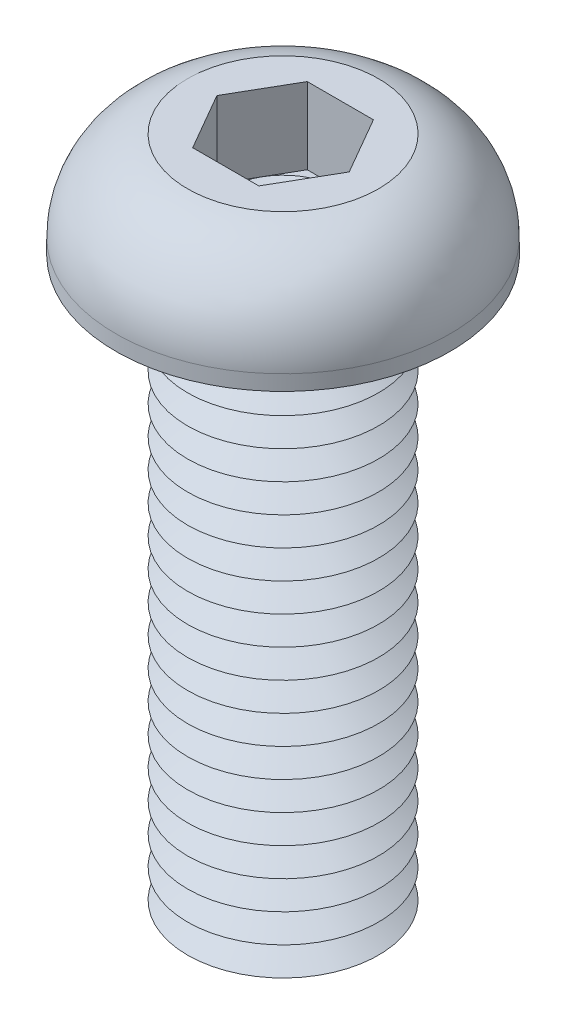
ISO-10303-21;
HEADER;
FILE_DESCRIPTION(('STEP AP214'),'2;1');
FILE_NAME('part.step','',(''),(''),'','','');
FILE_SCHEMA(('AUTOMOTIVE_DESIGN { 1 0 10303 214 1 1 1 1 }'));
ENDSEC;
DATA;
#1=APPLICATION_CONTEXT('core data for automotive mechanical design processes');
#2=APPLICATION_PROTOCOL_DEFINITION('international standard','automotive_design',2000,#1);
#3=PRODUCT_CONTEXT('',#1,'mechanical');
#4=PRODUCT('Part','Part','',(#3));
#5=PRODUCT_RELATED_PRODUCT_CATEGORY('part','',(#4));
#6=PRODUCT_DEFINITION_FORMATION('','',#4);
#7=PRODUCT_DEFINITION_CONTEXT('part definition',#1,'design');
#8=PRODUCT_DEFINITION('design','',#6,#7);
#9=PRODUCT_DEFINITION_SHAPE('','',#8);
#10=(LENGTH_UNIT() NAMED_UNIT(*) SI_UNIT(.MILLI.,.METRE.));
#11=(NAMED_UNIT(*) PLANE_ANGLE_UNIT() SI_UNIT($,.RADIAN.));
#12=(NAMED_UNIT(*) SI_UNIT($,.STERADIAN.) SOLID_ANGLE_UNIT());
#13=UNCERTAINTY_MEASURE_WITH_UNIT(LENGTH_MEASURE(1.E-05),#10,'distance_accuracy_value','');
#14=(GEOMETRIC_REPRESENTATION_CONTEXT(3) GLOBAL_UNCERTAINTY_ASSIGNED_CONTEXT((#13)) GLOBAL_UNIT_ASSIGNED_CONTEXT((#10,
#11,#12)) REPRESENTATION_CONTEXT('',''));
#15=CARTESIAN_POINT('',(0.,0.,0.));
#16=DIRECTION('',(0.,0.,1.));
#17=DIRECTION('',(1.,0.,0.));
#18=AXIS2_PLACEMENT_3D('',#15,#16,#17);
#19=CARTESIAN_POINT('',(0.,0.,0.));
#20=DIRECTION('',(0.,-1.,0.));
#21=DIRECTION('',(0.,0.,-1.));
#22=AXIS2_PLACEMENT_3D('',#19,#20,#21);
#23=TOROIDAL_SURFACE('',#22,5.75,0.75);
#24=CARTESIAN_POINT('',(0.,0.,-6.5));
#25=VERTEX_POINT('',#24);
#26=VERTEX_LOOP('',#25);
#27=FACE_BOUND('',#26,.T.);
#28=ADVANCED_FACE('P0_F12',(#27),#23,.T.);
#29=CLOSED_SHELL('',(#28));
#30=MANIFOLD_SOLID_BREP('P0_B1',#29);
#31=CARTESIAN_POINT('',(1.73205080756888,1.5,-3.));
#32=DIRECTION('',(0.,1.,0.));
#33=DIRECTION('',(0.,0.,1.));
#34=AXIS2_PLACEMENT_3D('',#31,#32,#33);
#35=PLANE('',#34);
#36=CARTESIAN_POINT('',(0.,1.5,0.));
#37=DIRECTION('',(0.,1.,0.));
#38=DIRECTION('',(0.,0.,1.));
#39=AXIS2_PLACEMENT_3D('',#36,#37,#38);
#40=CIRCLE('',#39,3.);
#41=CARTESIAN_POINT('',(0.,1.5,3.));
#42=VERTEX_POINT('',#41);
#43=CARTESIAN_POINT('',(2.59807621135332,1.5,1.5));
#44=VERTEX_POINT('',#43);
#45=EDGE_CURVE('P1_E93',#42,#44,#40,.T.);
#46=ORIENTED_EDGE('',*,*,#45,.F.);
#47=DIRECTION('',(1.,0.,0.));
#48=VECTOR('',#47,1.);
#49=CARTESIAN_POINT('',(-1.73205080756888,1.5,3.));
#50=LINE('',#49,#48);
#51=CARTESIAN_POINT('',(1.73205080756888,1.5,3.));
#52=VERTEX_POINT('',#51);
#53=EDGE_CURVE('P1_E116',#42,#52,#50,.T.);
#54=ORIENTED_EDGE('',*,*,#53,.T.);
#55=DIRECTION('',(0.5,0.,-0.866025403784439));
#56=VECTOR('',#55,1.);
#57=CARTESIAN_POINT('',(1.73205080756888,1.5,3.));
#58=LINE('',#57,#56);
#59=EDGE_CURVE('P1_E112',#52,#44,#58,.T.);
#60=ORIENTED_EDGE('',*,*,#59,.T.);
#61=EDGE_LOOP('',(#46,#54,#60));
#62=FACE_BOUND('',#61,.T.);
#63=ADVANCED_FACE('P1_F15',(#62),#35,.T.);
#64=CARTESIAN_POINT('',(0.,1.5,0.));
#65=DIRECTION('',(0.,1.,0.));
#66=DIRECTION('',(0.,0.,1.));
#67=AXIS2_PLACEMENT_3D('',#64,#65,#66);
#68=CIRCLE('',#67,3.);
#69=CARTESIAN_POINT('',(2.59807621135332,1.5,-1.5));
#70=VERTEX_POINT('',#69);
#71=EDGE_CURVE('P1_E10',#44,#70,#68,.T.);
#72=ORIENTED_EDGE('',*,*,#71,.F.);
#73=CARTESIAN_POINT('',(3.46410161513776,1.5,0.));
#74=VERTEX_POINT('',#73);
#75=EDGE_CURVE('P1_E104',#44,#74,#58,.T.);
#76=ORIENTED_EDGE('',*,*,#75,.T.);
#77=DIRECTION('',(-0.5,0.,-0.866025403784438));
#78=VECTOR('',#77,1.);
#79=CARTESIAN_POINT('',(3.46410161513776,1.5,0.));
#80=LINE('',#79,#78);
#81=EDGE_CURVE('P1_E107',#74,#70,#80,.T.);
#82=ORIENTED_EDGE('',*,*,#81,.T.);
#83=EDGE_LOOP('',(#72,#76,#82));
#84=FACE_BOUND('',#83,.T.);
#85=ADVANCED_FACE('P1_F103',(#84),#35,.T.);
#86=CARTESIAN_POINT('',(0.,1.5,-3.));
#87=VERTEX_POINT('',#86);
#88=EDGE_CURVE('P1_E24',#70,#87,#68,.T.);
#89=ORIENTED_EDGE('',*,*,#88,.F.);
#90=CARTESIAN_POINT('',(1.73205080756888,1.5,-3.));
#91=VERTEX_POINT('',#90);
#92=EDGE_CURVE('P1_E139',#70,#91,#80,.T.);
#93=ORIENTED_EDGE('',*,*,#92,.T.);
#94=DIRECTION('',(-1.,0.,0.));
#95=VECTOR('',#94,1.);
#96=CARTESIAN_POINT('',(1.73205080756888,1.5,-3.));
#97=LINE('',#96,#95);
#98=EDGE_CURVE('P1_E336',#91,#87,#97,.T.);
#99=ORIENTED_EDGE('',*,*,#98,.T.);
#100=EDGE_LOOP('',(#89,#93,#99));
#101=FACE_BOUND('',#100,.T.);
#102=ADVANCED_FACE('P1_F301',(#101),#35,.T.);
#103=CARTESIAN_POINT('',(-2.59807621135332,1.5,-1.5));
#104=VERTEX_POINT('',#103);
#105=EDGE_CURVE('P1_E331',#87,#104,#68,.T.);
#106=ORIENTED_EDGE('',*,*,#105,.F.);
#107=CARTESIAN_POINT('',(-1.73205080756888,1.5,-3.));
#108=VERTEX_POINT('',#107);
#109=EDGE_CURVE('P1_E340',#87,#108,#97,.T.);
#110=ORIENTED_EDGE('',*,*,#109,.T.);
#111=DIRECTION('',(-0.5,0.,0.866025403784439));
#112=VECTOR('',#111,1.);
#113=CARTESIAN_POINT('',(-1.73205080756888,1.5,-3.));
#114=LINE('',#113,#112);
#115=EDGE_CURVE('P1_E335',#108,#104,#114,.T.);
#116=ORIENTED_EDGE('',*,*,#115,.T.);
#117=EDGE_LOOP('',(#106,#110,#116));
#118=FACE_BOUND('',#117,.T.);
#119=ADVANCED_FACE('P1_F315',(#118),#35,.T.);
#120=CARTESIAN_POINT('',(-2.59807621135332,1.5,1.5));
#121=VERTEX_POINT('',#120);
#122=EDGE_CURVE('P1_E31',#104,#121,#68,.T.);
#123=ORIENTED_EDGE('',*,*,#122,.F.);
#124=CARTESIAN_POINT('',(-3.46410161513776,1.5,0.));
#125=VERTEX_POINT('',#124);
#126=EDGE_CURVE('P1_E327',#104,#125,#114,.T.);
#127=ORIENTED_EDGE('',*,*,#126,.T.);
#128=DIRECTION('',(0.5,0.,0.866025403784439));
#129=VECTOR('',#128,1.);
#130=CARTESIAN_POINT('',(-3.46410161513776,1.5,0.));
#131=LINE('',#130,#129);
#132=EDGE_CURVE('P1_E330',#125,#121,#131,.T.);
#133=ORIENTED_EDGE('',*,*,#132,.T.);
#134=EDGE_LOOP('',(#123,#127,#133));
#135=FACE_BOUND('',#134,.T.);
#136=ADVANCED_FACE('P1_F306',(#135),#35,.T.);
#137=CARTESIAN_POINT('',(0.,-28.5,0.));
#138=DIRECTION('',(0.,1.,0.));
#139=DIRECTION('',(0.,0.,1.));
#140=AXIS2_PLACEMENT_3D('',#137,#138,#139);
#141=CONICAL_SURFACE('',#140,3.70096189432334,1.0471975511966);
#142=CARTESIAN_POINT('',(0.,-27.75,0.));
#143=DIRECTION('',(0.,-1.,0.));
#144=DIRECTION('',(0.,0.,-1.));
#145=AXIS2_PLACEMENT_3D('',#142,#143,#144);
#146=CIRCLE('',#145,5.);
#147=CARTESIAN_POINT('',(0.,-27.75,-5.));
#148=VERTEX_POINT('',#147);
#149=EDGE_CURVE('P1_E263',#148,#148,#146,.T.);
#150=ORIENTED_EDGE('',*,*,#149,.T.);
#151=EDGE_LOOP('',(#150));
#152=FACE_BOUND('',#151,.T.);
#153=CARTESIAN_POINT('',(0.,-28.5,0.));
#154=DIRECTION('',(0.,-1.,0.));
#155=DIRECTION('',(0.,0.,-1.));
#156=AXIS2_PLACEMENT_3D('',#153,#154,#155);
#157=CIRCLE('',#156,3.70096189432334);
#158=CARTESIAN_POINT('',(0.,-28.5,-3.70096189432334));
#159=VERTEX_POINT('',#158);
#160=EDGE_CURVE('P1_E266',#159,#159,#157,.T.);
#161=ORIENTED_EDGE('',*,*,#160,.F.);
#162=EDGE_LOOP('',(#161));
#163=FACE_BOUND('',#162,.T.);
#164=ADVANCED_FACE('P1_F314',(#152,#163),#141,.T.);
#165=CARTESIAN_POINT('',(0.,-29.25,0.));
#166=DIRECTION('',(0.,-1.,0.));
#167=DIRECTION('',(0.,0.,-1.));
#168=AXIS2_PLACEMENT_3D('',#165,#166,#167);
#169=CONICAL_SURFACE('',#168,5.,1.0471975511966);
#170=ORIENTED_EDGE('',*,*,#160,.T.);
#171=EDGE_LOOP('',(#170));
#172=FACE_BOUND('',#171,.T.);
#173=CARTESIAN_POINT('',(0.,-29.25,0.));
#174=DIRECTION('',(0.,-1.,0.));
#175=DIRECTION('',(0.,0.,-1.));
#176=AXIS2_PLACEMENT_3D('',#173,#174,#175);
#177=CIRCLE('',#176,5.);
#178=CARTESIAN_POINT('',(0.,-29.25,-5.));
#179=VERTEX_POINT('',#178);
#180=EDGE_CURVE('P1_E269',#179,#179,#177,.T.);
#181=ORIENTED_EDGE('',*,*,#180,.F.);
#182=EDGE_LOOP('',(#181));
#183=FACE_BOUND('',#182,.T.);
#184=ADVANCED_FACE('P1_F321',(#172,#183),#169,.T.);
#185=CARTESIAN_POINT('',(0.,-30.,0.));
#186=DIRECTION('',(0.,1.,0.));
#187=DIRECTION('',(0.,0.,1.));
#188=AXIS2_PLACEMENT_3D('',#185,#186,#187);
#189=PLANE('',#188);
#190=CARTESIAN_POINT('',(0.,-30.,0.));
#191=DIRECTION('',(0.,-1.,0.));
#192=DIRECTION('',(0.,0.,-1.));
#193=AXIS2_PLACEMENT_3D('',#190,#191,#192);
#194=CIRCLE('',#193,3.70096189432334);
#195=CARTESIAN_POINT('',(0.,-30.,-3.70096189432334));
#196=VERTEX_POINT('',#195);
#197=EDGE_CURVE('P1_E272',#196,#196,#194,.T.);
#198=ORIENTED_EDGE('',*,*,#197,.T.);
#199=EDGE_LOOP('',(#198));
#200=FACE_BOUND('',#199,.T.);
#201=ADVANCED_FACE('P1_F399',(#200),#189,.F.);
#202=CARTESIAN_POINT('',(0.,-30.,0.));
#203=DIRECTION('',(0.,1.,0.));
#204=DIRECTION('',(0.,0.,1.));
#205=AXIS2_PLACEMENT_3D('',#202,#203,#204);
#206=CONICAL_SURFACE('',#205,3.70096189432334,1.0471975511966);
#207=ORIENTED_EDGE('',*,*,#180,.T.);
#208=EDGE_LOOP('',(#207));
#209=FACE_BOUND('',#208,.T.);
#210=ORIENTED_EDGE('',*,*,#197,.F.);
#211=EDGE_LOOP('',(#210));
#212=FACE_BOUND('',#211,.T.);
#213=ADVANCED_FACE('P1_F410',(#209,#212),#206,.T.);
#214=CARTESIAN_POINT('',(0.,-27.,0.));
#215=DIRECTION('',(0.,1.,0.));
#216=DIRECTION('',(0.,0.,1.));
#217=AXIS2_PLACEMENT_3D('',#214,#215,#216);
#218=CONICAL_SURFACE('',#217,3.70096189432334,1.0471975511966);
#219=CARTESIAN_POINT('',(0.,-26.25,0.));
#220=DIRECTION('',(0.,-1.,0.));
#221=DIRECTION('',(0.,0.,-1.));
#222=AXIS2_PLACEMENT_3D('',#219,#220,#221);
#223=CIRCLE('',#222,5.);
#224=CARTESIAN_POINT('',(0.,-26.25,-5.));
#225=VERTEX_POINT('',#224);
#226=EDGE_CURVE('P1_E257',#225,#225,#223,.T.);
#227=ORIENTED_EDGE('',*,*,#226,.T.);
#228=EDGE_LOOP('',(#227));
#229=FACE_BOUND('',#228,.T.);
#230=CARTESIAN_POINT('',(0.,-27.,0.));
#231=DIRECTION('',(0.,-1.,0.));
#232=DIRECTION('',(0.,0.,-1.));
#233=AXIS2_PLACEMENT_3D('',#230,#231,#232);
#234=CIRCLE('',#233,3.70096189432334);
#235=CARTESIAN_POINT('',(0.,-27.,-3.70096189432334));
#236=VERTEX_POINT('',#235);
#237=EDGE_CURVE('P1_E260',#236,#236,#234,.T.);
#238=ORIENTED_EDGE('',*,*,#237,.F.);
#239=EDGE_LOOP('',(#238));
#240=FACE_BOUND('',#239,.T.);
#241=ADVANCED_FACE('P1_F419',(#229,#240),#218,.T.);
#242=CARTESIAN_POINT('',(0.,-27.75,0.));
#243=DIRECTION('',(0.,-1.,0.));
#244=DIRECTION('',(0.,0.,-1.));
#245=AXIS2_PLACEMENT_3D('',#242,#243,#244);
#246=CONICAL_SURFACE('',#245,5.,1.0471975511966);
#247=ORIENTED_EDGE('',*,*,#237,.T.);
#248=EDGE_LOOP('',(#247));
#249=FACE_BOUND('',#248,.T.);
#250=ORIENTED_EDGE('',*,*,#149,.F.);
#251=EDGE_LOOP('',(#250));
#252=FACE_BOUND('',#251,.T.);
#253=ADVANCED_FACE('P1_F428',(#249,#252),#246,.T.);
#254=CARTESIAN_POINT('',(0.,-25.5,0.));
#255=DIRECTION('',(0.,1.,0.));
#256=DIRECTION('',(0.,0.,1.));
#257=AXIS2_PLACEMENT_3D('',#254,#255,#256);
#258=CONICAL_SURFACE('',#257,3.70096189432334,1.0471975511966);
#259=CARTESIAN_POINT('',(0.,-24.75,0.));
#260=DIRECTION('',(0.,-1.,0.));
#261=DIRECTION('',(0.,0.,-1.));
#262=AXIS2_PLACEMENT_3D('',#259,#260,#261);
#263=CIRCLE('',#262,5.);
#264=CARTESIAN_POINT('',(0.,-24.75,-5.));
#265=VERTEX_POINT('',#264);
#266=EDGE_CURVE('P1_E251',#265,#265,#263,.T.);
#267=ORIENTED_EDGE('',*,*,#266,.T.);
#268=EDGE_LOOP('',(#267));
#269=FACE_BOUND('',#268,.T.);
#270=CARTESIAN_POINT('',(0.,-25.5,0.));
#271=DIRECTION('',(0.,-1.,0.));
#272=DIRECTION('',(0.,0.,-1.));
#273=AXIS2_PLACEMENT_3D('',#270,#271,#272);
#274=CIRCLE('',#273,3.70096189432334);
#275=CARTESIAN_POINT('',(0.,-25.5,-3.70096189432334));
#276=VERTEX_POINT('',#275);
#277=EDGE_CURVE('P1_E254',#276,#276,#274,.T.);
#278=ORIENTED_EDGE('',*,*,#277,.F.);
#279=EDGE_LOOP('',(#278));
#280=FACE_BOUND('',#279,.T.);
#281=ADVANCED_FACE('P1_F438',(#269,#280),#258,.T.);
#282=CARTESIAN_POINT('',(0.,-26.25,0.));
#283=DIRECTION('',(0.,-1.,0.));
#284=DIRECTION('',(0.,0.,-1.));
#285=AXIS2_PLACEMENT_3D('',#282,#283,#284);
#286=CONICAL_SURFACE('',#285,5.,1.0471975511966);
#287=ORIENTED_EDGE('',*,*,#277,.T.);
#288=EDGE_LOOP('',(#287));
#289=FACE_BOUND('',#288,.T.);
#290=ORIENTED_EDGE('',*,*,#226,.F.);
#291=EDGE_LOOP('',(#290));
#292=FACE_BOUND('',#291,.T.);
#293=ADVANCED_FACE('P1_F448',(#289,#292),#286,.T.);
#294=CARTESIAN_POINT('',(0.,-24.,0.));
#295=DIRECTION('',(0.,1.,0.));
#296=DIRECTION('',(0.,0.,1.));
#297=AXIS2_PLACEMENT_3D('',#294,#295,#296);
#298=CONICAL_SURFACE('',#297,3.70096189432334,1.0471975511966);
#299=CARTESIAN_POINT('',(0.,-23.25,0.));
#300=DIRECTION('',(0.,-1.,0.));
#301=DIRECTION('',(0.,0.,-1.));
#302=AXIS2_PLACEMENT_3D('',#299,#300,#301);
#303=CIRCLE('',#302,5.);
#304=CARTESIAN_POINT('',(0.,-23.25,-5.));
#305=VERTEX_POINT('',#304);
#306=EDGE_CURVE('P1_E245',#305,#305,#303,.T.);
#307=ORIENTED_EDGE('',*,*,#306,.T.);
#308=EDGE_LOOP('',(#307));
#309=FACE_BOUND('',#308,.T.);
#310=CARTESIAN_POINT('',(0.,-24.,0.));
#311=DIRECTION('',(0.,-1.,0.));
#312=DIRECTION('',(0.,0.,-1.));
#313=AXIS2_PLACEMENT_3D('',#310,#311,#312);
#314=CIRCLE('',#313,3.70096189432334);
#315=CARTESIAN_POINT('',(0.,-24.,-3.70096189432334));
#316=VERTEX_POINT('',#315);
#317=EDGE_CURVE('P1_E248',#316,#316,#314,.T.);
#318=ORIENTED_EDGE('',*,*,#317,.F.);
#319=EDGE_LOOP('',(#318));
#320=FACE_BOUND('',#319,.T.);
#321=ADVANCED_FACE('P1_F458',(#309,#320),#298,.T.);
#322=CARTESIAN_POINT('',(0.,-24.75,0.));
#323=DIRECTION('',(0.,-1.,0.));
#324=DIRECTION('',(0.,0.,-1.));
#325=AXIS2_PLACEMENT_3D('',#322,#323,#324);
#326=CONICAL_SURFACE('',#325,5.,1.0471975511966);
#327=ORIENTED_EDGE('',*,*,#317,.T.);
#328=EDGE_LOOP('',(#327));
#329=FACE_BOUND('',#328,.T.);
#330=ORIENTED_EDGE('',*,*,#266,.F.);
#331=EDGE_LOOP('',(#330));
#332=FACE_BOUND('',#331,.T.);
#333=ADVANCED_FACE('P1_F468',(#329,#332),#326,.T.);
#334=CARTESIAN_POINT('',(0.,-22.5,0.));
#335=DIRECTION('',(0.,1.,0.));
#336=DIRECTION('',(0.,0.,1.));
#337=AXIS2_PLACEMENT_3D('',#334,#335,#336);
#338=CONICAL_SURFACE('',#337,3.70096189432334,1.0471975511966);
#339=CARTESIAN_POINT('',(0.,-21.75,0.));
#340=DIRECTION('',(0.,-1.,0.));
#341=DIRECTION('',(0.,0.,-1.));
#342=AXIS2_PLACEMENT_3D('',#339,#340,#341);
#343=CIRCLE('',#342,5.);
#344=CARTESIAN_POINT('',(0.,-21.75,-5.));
#345=VERTEX_POINT('',#344);
#346=EDGE_CURVE('P1_E239',#345,#345,#343,.T.);
#347=ORIENTED_EDGE('',*,*,#346,.T.);
#348=EDGE_LOOP('',(#347));
#349=FACE_BOUND('',#348,.T.);
#350=CARTESIAN_POINT('',(0.,-22.5,0.));
#351=DIRECTION('',(0.,-1.,0.));
#352=DIRECTION('',(0.,0.,-1.));
#353=AXIS2_PLACEMENT_3D('',#350,#351,#352);
#354=CIRCLE('',#353,3.70096189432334);
#355=CARTESIAN_POINT('',(0.,-22.5,-3.70096189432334));
#356=VERTEX_POINT('',#355);
#357=EDGE_CURVE('P1_E242',#356,#356,#354,.T.);
#358=ORIENTED_EDGE('',*,*,#357,.F.);
#359=EDGE_LOOP('',(#358));
#360=FACE_BOUND('',#359,.T.);
#361=ADVANCED_FACE('P1_F478',(#349,#360),#338,.T.);
#362=CARTESIAN_POINT('',(0.,-23.25,0.));
#363=DIRECTION('',(0.,-1.,0.));
#364=DIRECTION('',(0.,0.,-1.));
#365=AXIS2_PLACEMENT_3D('',#362,#363,#364);
#366=CONICAL_SURFACE('',#365,5.,1.0471975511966);
#367=ORIENTED_EDGE('',*,*,#357,.T.);
#368=EDGE_LOOP('',(#367));
#369=FACE_BOUND('',#368,.T.);
#370=ORIENTED_EDGE('',*,*,#306,.F.);
#371=EDGE_LOOP('',(#370));
#372=FACE_BOUND('',#371,.T.);
#373=ADVANCED_FACE('P1_F488',(#369,#372),#366,.T.);
#374=CARTESIAN_POINT('',(0.,-21.,0.));
#375=DIRECTION('',(0.,1.,0.));
#376=DIRECTION('',(0.,0.,1.));
#377=AXIS2_PLACEMENT_3D('',#374,#375,#376);
#378=CONICAL_SURFACE('',#377,3.70096189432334,1.0471975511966);
#379=CARTESIAN_POINT('',(0.,-20.25,0.));
#380=DIRECTION('',(0.,-1.,0.));
#381=DIRECTION('',(0.,0.,-1.));
#382=AXIS2_PLACEMENT_3D('',#379,#380,#381);
#383=CIRCLE('',#382,5.);
#384=CARTESIAN_POINT('',(0.,-20.25,-5.));
#385=VERTEX_POINT('',#384);
#386=EDGE_CURVE('P1_E233',#385,#385,#383,.T.);
#387=ORIENTED_EDGE('',*,*,#386,.T.);
#388=EDGE_LOOP('',(#387));
#389=FACE_BOUND('',#388,.T.);
#390=CARTESIAN_POINT('',(0.,-21.,0.));
#391=DIRECTION('',(0.,-1.,0.));
#392=DIRECTION('',(0.,0.,-1.));
#393=AXIS2_PLACEMENT_3D('',#390,#391,#392);
#394=CIRCLE('',#393,3.70096189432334);
#395=CARTESIAN_POINT('',(0.,-21.,-3.70096189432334));
#396=VERTEX_POINT('',#395);
#397=EDGE_CURVE('P1_E236',#396,#396,#394,.T.);
#398=ORIENTED_EDGE('',*,*,#397,.F.);
#399=EDGE_LOOP('',(#398));
#400=FACE_BOUND('',#399,.T.);
#401=ADVANCED_FACE('P1_F498',(#389,#400),#378,.T.);
#402=CARTESIAN_POINT('',(0.,-21.75,0.));
#403=DIRECTION('',(0.,-1.,0.));
#404=DIRECTION('',(0.,0.,-1.));
#405=AXIS2_PLACEMENT_3D('',#402,#403,#404);
#406=CONICAL_SURFACE('',#405,5.,1.0471975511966);
#407=ORIENTED_EDGE('',*,*,#397,.T.);
#408=EDGE_LOOP('',(#407));
#409=FACE_BOUND('',#408,.T.);
#410=ORIENTED_EDGE('',*,*,#346,.F.);
#411=EDGE_LOOP('',(#410));
#412=FACE_BOUND('',#411,.T.);
#413=ADVANCED_FACE('P1_F508',(#409,#412),#406,.T.);
#414=CARTESIAN_POINT('',(0.,-19.5,0.));
#415=DIRECTION('',(0.,1.,0.));
#416=DIRECTION('',(0.,0.,1.));
#417=AXIS2_PLACEMENT_3D('',#414,#415,#416);
#418=CONICAL_SURFACE('',#417,3.70096189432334,1.0471975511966);
#419=CARTESIAN_POINT('',(0.,-18.75,0.));
#420=DIRECTION('',(0.,-1.,0.));
#421=DIRECTION('',(0.,0.,-1.));
#422=AXIS2_PLACEMENT_3D('',#419,#420,#421);
#423=CIRCLE('',#422,5.);
#424=CARTESIAN_POINT('',(0.,-18.75,-5.));
#425=VERTEX_POINT('',#424);
#426=EDGE_CURVE('P1_E227',#425,#425,#423,.T.);
#427=ORIENTED_EDGE('',*,*,#426,.T.);
#428=EDGE_LOOP('',(#427));
#429=FACE_BOUND('',#428,.T.);
#430=CARTESIAN_POINT('',(0.,-19.5,0.));
#431=DIRECTION('',(0.,-1.,0.));
#432=DIRECTION('',(0.,0.,-1.));
#433=AXIS2_PLACEMENT_3D('',#430,#431,#432);
#434=CIRCLE('',#433,3.70096189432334);
#435=CARTESIAN_POINT('',(0.,-19.5,-3.70096189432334));
#436=VERTEX_POINT('',#435);
#437=EDGE_CURVE('P1_E230',#436,#436,#434,.T.);
#438=ORIENTED_EDGE('',*,*,#437,.F.);
#439=EDGE_LOOP('',(#438));
#440=FACE_BOUND('',#439,.T.);
#441=ADVANCED_FACE('P1_F518',(#429,#440),#418,.T.);
#442=CARTESIAN_POINT('',(0.,-20.25,0.));
#443=DIRECTION('',(0.,-1.,0.));
#444=DIRECTION('',(0.,0.,-1.));
#445=AXIS2_PLACEMENT_3D('',#442,#443,#444);
#446=CONICAL_SURFACE('',#445,5.,1.0471975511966);
#447=ORIENTED_EDGE('',*,*,#437,.T.);
#448=EDGE_LOOP('',(#447));
#449=FACE_BOUND('',#448,.T.);
#450=ORIENTED_EDGE('',*,*,#386,.F.);
#451=EDGE_LOOP('',(#450));
#452=FACE_BOUND('',#451,.T.);
#453=ADVANCED_FACE('P1_F528',(#449,#452),#446,.T.);
#454=CARTESIAN_POINT('',(0.,-18.,0.));
#455=DIRECTION('',(0.,1.,0.));
#456=DIRECTION('',(0.,0.,1.));
#457=AXIS2_PLACEMENT_3D('',#454,#455,#456);
#458=CONICAL_SURFACE('',#457,3.70096189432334,1.0471975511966);
#459=CARTESIAN_POINT('',(0.,-17.25,0.));
#460=DIRECTION('',(0.,-1.,0.));
#461=DIRECTION('',(0.,0.,-1.));
#462=AXIS2_PLACEMENT_3D('',#459,#460,#461);
#463=CIRCLE('',#462,5.);
#464=CARTESIAN_POINT('',(0.,-17.25,-5.));
#465=VERTEX_POINT('',#464);
#466=EDGE_CURVE('P1_E221',#465,#465,#463,.T.);
#467=ORIENTED_EDGE('',*,*,#466,.T.);
#468=EDGE_LOOP('',(#467));
#469=FACE_BOUND('',#468,.T.);
#470=CARTESIAN_POINT('',(0.,-18.,0.));
#471=DIRECTION('',(0.,-1.,0.));
#472=DIRECTION('',(0.,0.,-1.));
#473=AXIS2_PLACEMENT_3D('',#470,#471,#472);
#474=CIRCLE('',#473,3.70096189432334);
#475=CARTESIAN_POINT('',(0.,-18.,-3.70096189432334));
#476=VERTEX_POINT('',#475);
#477=EDGE_CURVE('P1_E224',#476,#476,#474,.T.);
#478=ORIENTED_EDGE('',*,*,#477,.F.);
#479=EDGE_LOOP('',(#478));
#480=FACE_BOUND('',#479,.T.);
#481=ADVANCED_FACE('P1_F538',(#469,#480),#458,.T.);
#482=CARTESIAN_POINT('',(0.,-18.75,0.));
#483=DIRECTION('',(0.,-1.,0.));
#484=DIRECTION('',(0.,0.,-1.));
#485=AXIS2_PLACEMENT_3D('',#482,#483,#484);
#486=CONICAL_SURFACE('',#485,5.,1.0471975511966);
#487=ORIENTED_EDGE('',*,*,#477,.T.);
#488=EDGE_LOOP('',(#487));
#489=FACE_BOUND('',#488,.T.);
#490=ORIENTED_EDGE('',*,*,#426,.F.);
#491=EDGE_LOOP('',(#490));
#492=FACE_BOUND('',#491,.T.);
#493=ADVANCED_FACE('P1_F548',(#489,#492),#486,.T.);
#494=CARTESIAN_POINT('',(0.,-16.5,0.));
#495=DIRECTION('',(0.,1.,0.));
#496=DIRECTION('',(0.,0.,1.));
#497=AXIS2_PLACEMENT_3D('',#494,#495,#496);
#498=CONICAL_SURFACE('',#497,3.70096189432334,1.0471975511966);
#499=CARTESIAN_POINT('',(0.,-15.75,0.));
#500=DIRECTION('',(0.,-1.,0.));
#501=DIRECTION('',(0.,0.,-1.));
#502=AXIS2_PLACEMENT_3D('',#499,#500,#501);
#503=CIRCLE('',#502,5.);
#504=CARTESIAN_POINT('',(0.,-15.75,-5.));
#505=VERTEX_POINT('',#504);
#506=EDGE_CURVE('P1_E215',#505,#505,#503,.T.);
#507=ORIENTED_EDGE('',*,*,#506,.T.);
#508=EDGE_LOOP('',(#507));
#509=FACE_BOUND('',#508,.T.);
#510=CARTESIAN_POINT('',(0.,-16.5,0.));
#511=DIRECTION('',(0.,-1.,0.));
#512=DIRECTION('',(0.,0.,-1.));
#513=AXIS2_PLACEMENT_3D('',#510,#511,#512);
#514=CIRCLE('',#513,3.70096189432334);
#515=CARTESIAN_POINT('',(0.,-16.5,-3.70096189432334));
#516=VERTEX_POINT('',#515);
#517=EDGE_CURVE('P1_E218',#516,#516,#514,.T.);
#518=ORIENTED_EDGE('',*,*,#517,.F.);
#519=EDGE_LOOP('',(#518));
#520=FACE_BOUND('',#519,.T.);
#521=ADVANCED_FACE('P1_F558',(#509,#520),#498,.T.);
#522=CARTESIAN_POINT('',(0.,-17.25,0.));
#523=DIRECTION('',(0.,-1.,0.));
#524=DIRECTION('',(0.,0.,-1.));
#525=AXIS2_PLACEMENT_3D('',#522,#523,#524);
#526=CONICAL_SURFACE('',#525,5.,1.0471975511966);
#527=ORIENTED_EDGE('',*,*,#517,.T.);
#528=EDGE_LOOP('',(#527));
#529=FACE_BOUND('',#528,.T.);
#530=ORIENTED_EDGE('',*,*,#466,.F.);
#531=EDGE_LOOP('',(#530));
#532=FACE_BOUND('',#531,.T.);
#533=ADVANCED_FACE('P1_F568',(#529,#532),#526,.T.);
#534=CARTESIAN_POINT('',(0.,-15.,0.));
#535=DIRECTION('',(0.,1.,0.));
#536=DIRECTION('',(0.,0.,1.));
#537=AXIS2_PLACEMENT_3D('',#534,#535,#536);
#538=CONICAL_SURFACE('',#537,3.70096189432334,1.0471975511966);
#539=CARTESIAN_POINT('',(0.,-14.25,0.));
#540=DIRECTION('',(0.,-1.,0.));
#541=DIRECTION('',(0.,0.,-1.));
#542=AXIS2_PLACEMENT_3D('',#539,#540,#541);
#543=CIRCLE('',#542,5.);
#544=CARTESIAN_POINT('',(0.,-14.25,-5.));
#545=VERTEX_POINT('',#544);
#546=EDGE_CURVE('P1_E209',#545,#545,#543,.T.);
#547=ORIENTED_EDGE('',*,*,#546,.T.);
#548=EDGE_LOOP('',(#547));
#549=FACE_BOUND('',#548,.T.);
#550=CARTESIAN_POINT('',(0.,-15.,0.));
#551=DIRECTION('',(0.,-1.,0.));
#552=DIRECTION('',(0.,0.,-1.));
#553=AXIS2_PLACEMENT_3D('',#550,#551,#552);
#554=CIRCLE('',#553,3.70096189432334);
#555=CARTESIAN_POINT('',(0.,-15.,-3.70096189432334));
#556=VERTEX_POINT('',#555);
#557=EDGE_CURVE('P1_E212',#556,#556,#554,.T.);
#558=ORIENTED_EDGE('',*,*,#557,.F.);
#559=EDGE_LOOP('',(#558));
#560=FACE_BOUND('',#559,.T.);
#561=ADVANCED_FACE('P1_F578',(#549,#560),#538,.T.);
#562=CARTESIAN_POINT('',(0.,-15.75,0.));
#563=DIRECTION('',(0.,-1.,0.));
#564=DIRECTION('',(0.,0.,-1.));
#565=AXIS2_PLACEMENT_3D('',#562,#563,#564);
#566=CONICAL_SURFACE('',#565,5.,1.0471975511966);
#567=ORIENTED_EDGE('',*,*,#557,.T.);
#568=EDGE_LOOP('',(#567));
#569=FACE_BOUND('',#568,.T.);
#570=ORIENTED_EDGE('',*,*,#506,.F.);
#571=EDGE_LOOP('',(#570));
#572=FACE_BOUND('',#571,.T.);
#573=ADVANCED_FACE('P1_F588',(#569,#572),#566,.T.);
#574=CARTESIAN_POINT('',(0.,-13.5,0.));
#575=DIRECTION('',(0.,1.,0.));
#576=DIRECTION('',(0.,0.,1.));
#577=AXIS2_PLACEMENT_3D('',#574,#575,#576);
#578=CONICAL_SURFACE('',#577,3.70096189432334,1.0471975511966);
#579=CARTESIAN_POINT('',(0.,-12.75,0.));
#580=DIRECTION('',(0.,-1.,0.));
#581=DIRECTION('',(0.,0.,-1.));
#582=AXIS2_PLACEMENT_3D('',#579,#580,#581);
#583=CIRCLE('',#582,5.);
#584=CARTESIAN_POINT('',(0.,-12.75,-5.));
#585=VERTEX_POINT('',#584);
#586=EDGE_CURVE('P1_E203',#585,#585,#583,.T.);
#587=ORIENTED_EDGE('',*,*,#586,.T.);
#588=EDGE_LOOP('',(#587));
#589=FACE_BOUND('',#588,.T.);
#590=CARTESIAN_POINT('',(0.,-13.5,0.));
#591=DIRECTION('',(0.,-1.,0.));
#592=DIRECTION('',(0.,0.,-1.));
#593=AXIS2_PLACEMENT_3D('',#590,#591,#592);
#594=CIRCLE('',#593,3.70096189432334);
#595=CARTESIAN_POINT('',(0.,-13.5,-3.70096189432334));
#596=VERTEX_POINT('',#595);
#597=EDGE_CURVE('P1_E206',#596,#596,#594,.T.);
#598=ORIENTED_EDGE('',*,*,#597,.F.);
#599=EDGE_LOOP('',(#598));
#600=FACE_BOUND('',#599,.T.);
#601=ADVANCED_FACE('P1_F598',(#589,#600),#578,.T.);
#602=CARTESIAN_POINT('',(0.,-14.25,0.));
#603=DIRECTION('',(0.,-1.,0.));
#604=DIRECTION('',(0.,0.,-1.));
#605=AXIS2_PLACEMENT_3D('',#602,#603,#604);
#606=CONICAL_SURFACE('',#605,5.,1.0471975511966);
#607=ORIENTED_EDGE('',*,*,#597,.T.);
#608=EDGE_LOOP('',(#607));
#609=FACE_BOUND('',#608,.T.);
#610=ORIENTED_EDGE('',*,*,#546,.F.);
#611=EDGE_LOOP('',(#610));
#612=FACE_BOUND('',#611,.T.);
#613=ADVANCED_FACE('P1_F608',(#609,#612),#606,.T.);
#614=CARTESIAN_POINT('',(0.,-12.,0.));
#615=DIRECTION('',(0.,1.,0.));
#616=DIRECTION('',(0.,0.,1.));
#617=AXIS2_PLACEMENT_3D('',#614,#615,#616);
#618=CONICAL_SURFACE('',#617,3.70096189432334,1.0471975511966);
#619=CARTESIAN_POINT('',(0.,-11.25,0.));
#620=DIRECTION('',(0.,-1.,0.));
#621=DIRECTION('',(0.,0.,-1.));
#622=AXIS2_PLACEMENT_3D('',#619,#620,#621);
#623=CIRCLE('',#622,5.);
#624=CARTESIAN_POINT('',(0.,-11.25,-5.));
#625=VERTEX_POINT('',#624);
#626=EDGE_CURVE('P1_E197',#625,#625,#623,.T.);
#627=ORIENTED_EDGE('',*,*,#626,.T.);
#628=EDGE_LOOP('',(#627));
#629=FACE_BOUND('',#628,.T.);
#630=CARTESIAN_POINT('',(0.,-12.,0.));
#631=DIRECTION('',(0.,-1.,0.));
#632=DIRECTION('',(0.,0.,-1.));
#633=AXIS2_PLACEMENT_3D('',#630,#631,#632);
#634=CIRCLE('',#633,3.70096189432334);
#635=CARTESIAN_POINT('',(0.,-12.,-3.70096189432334));
#636=VERTEX_POINT('',#635);
#637=EDGE_CURVE('P1_E200',#636,#636,#634,.T.);
#638=ORIENTED_EDGE('',*,*,#637,.F.);
#639=EDGE_LOOP('',(#638));
#640=FACE_BOUND('',#639,.T.);
#641=ADVANCED_FACE('P1_F618',(#629,#640),#618,.T.);
#642=CARTESIAN_POINT('',(0.,-12.75,0.));
#643=DIRECTION('',(0.,-1.,0.));
#644=DIRECTION('',(0.,0.,-1.));
#645=AXIS2_PLACEMENT_3D('',#642,#643,#644);
#646=CONICAL_SURFACE('',#645,5.,1.0471975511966);
#647=ORIENTED_EDGE('',*,*,#637,.T.);
#648=EDGE_LOOP('',(#647));
#649=FACE_BOUND('',#648,.T.);
#650=ORIENTED_EDGE('',*,*,#586,.F.);
#651=EDGE_LOOP('',(#650));
#652=FACE_BOUND('',#651,.T.);
#653=ADVANCED_FACE('P1_F628',(#649,#652),#646,.T.);
#654=CARTESIAN_POINT('',(0.,-10.5,0.));
#655=DIRECTION('',(0.,1.,0.));
#656=DIRECTION('',(0.,0.,1.));
#657=AXIS2_PLACEMENT_3D('',#654,#655,#656);
#658=CONICAL_SURFACE('',#657,3.70096189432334,1.0471975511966);
#659=CARTESIAN_POINT('',(0.,-9.75,0.));
#660=DIRECTION('',(0.,-1.,0.));
#661=DIRECTION('',(0.,0.,-1.));
#662=AXIS2_PLACEMENT_3D('',#659,#660,#661);
#663=CIRCLE('',#662,5.);
#664=CARTESIAN_POINT('',(0.,-9.75,-5.));
#665=VERTEX_POINT('',#664);
#666=EDGE_CURVE('P1_E191',#665,#665,#663,.T.);
#667=ORIENTED_EDGE('',*,*,#666,.T.);
#668=EDGE_LOOP('',(#667));
#669=FACE_BOUND('',#668,.T.);
#670=CARTESIAN_POINT('',(0.,-10.5,0.));
#671=DIRECTION('',(0.,-1.,0.));
#672=DIRECTION('',(0.,0.,-1.));
#673=AXIS2_PLACEMENT_3D('',#670,#671,#672);
#674=CIRCLE('',#673,3.70096189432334);
#675=CARTESIAN_POINT('',(0.,-10.5,-3.70096189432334));
#676=VERTEX_POINT('',#675);
#677=EDGE_CURVE('P1_E194',#676,#676,#674,.T.);
#678=ORIENTED_EDGE('',*,*,#677,.F.);
#679=EDGE_LOOP('',(#678));
#680=FACE_BOUND('',#679,.T.);
#681=ADVANCED_FACE('P1_F638',(#669,#680),#658,.T.);
#682=CARTESIAN_POINT('',(0.,-11.25,0.));
#683=DIRECTION('',(0.,-1.,0.));
#684=DIRECTION('',(0.,0.,-1.));
#685=AXIS2_PLACEMENT_3D('',#682,#683,#684);
#686=CONICAL_SURFACE('',#685,5.,1.0471975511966);
#687=ORIENTED_EDGE('',*,*,#677,.T.);
#688=EDGE_LOOP('',(#687));
#689=FACE_BOUND('',#688,.T.);
#690=ORIENTED_EDGE('',*,*,#626,.F.);
#691=EDGE_LOOP('',(#690));
#692=FACE_BOUND('',#691,.T.);
#693=ADVANCED_FACE('P1_F648',(#689,#692),#686,.T.);
#694=CARTESIAN_POINT('',(0.,-9.,0.));
#695=DIRECTION('',(0.,1.,0.));
#696=DIRECTION('',(0.,0.,1.));
#697=AXIS2_PLACEMENT_3D('',#694,#695,#696);
#698=CONICAL_SURFACE('',#697,3.70096189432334,1.0471975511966);
#699=CARTESIAN_POINT('',(0.,-8.25,0.));
#700=DIRECTION('',(0.,-1.,0.));
#701=DIRECTION('',(0.,0.,-1.));
#702=AXIS2_PLACEMENT_3D('',#699,#700,#701);
#703=CIRCLE('',#702,5.);
#704=CARTESIAN_POINT('',(0.,-8.25,-5.));
#705=VERTEX_POINT('',#704);
#706=EDGE_CURVE('P1_E185',#705,#705,#703,.T.);
#707=ORIENTED_EDGE('',*,*,#706,.T.);
#708=EDGE_LOOP('',(#707));
#709=FACE_BOUND('',#708,.T.);
#710=CARTESIAN_POINT('',(0.,-9.,0.));
#711=DIRECTION('',(0.,-1.,0.));
#712=DIRECTION('',(0.,0.,-1.));
#713=AXIS2_PLACEMENT_3D('',#710,#711,#712);
#714=CIRCLE('',#713,3.70096189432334);
#715=CARTESIAN_POINT('',(0.,-9.,-3.70096189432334));
#716=VERTEX_POINT('',#715);
#717=EDGE_CURVE('P1_E188',#716,#716,#714,.T.);
#718=ORIENTED_EDGE('',*,*,#717,.F.);
#719=EDGE_LOOP('',(#718));
#720=FACE_BOUND('',#719,.T.);
#721=ADVANCED_FACE('P1_F658',(#709,#720),#698,.T.);
#722=CARTESIAN_POINT('',(0.,-9.75,0.));
#723=DIRECTION('',(0.,-1.,0.));
#724=DIRECTION('',(0.,0.,-1.));
#725=AXIS2_PLACEMENT_3D('',#722,#723,#724);
#726=CONICAL_SURFACE('',#725,5.,1.0471975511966);
#727=ORIENTED_EDGE('',*,*,#717,.T.);
#728=EDGE_LOOP('',(#727));
#729=FACE_BOUND('',#728,.T.);
#730=ORIENTED_EDGE('',*,*,#666,.F.);
#731=EDGE_LOOP('',(#730));
#732=FACE_BOUND('',#731,.T.);
#733=ADVANCED_FACE('P1_F668',(#729,#732),#726,.T.);
#734=CARTESIAN_POINT('',(0.,-7.5,0.));
#735=DIRECTION('',(0.,1.,0.));
#736=DIRECTION('',(0.,0.,1.));
#737=AXIS2_PLACEMENT_3D('',#734,#735,#736);
#738=CONICAL_SURFACE('',#737,3.70096189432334,1.0471975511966);
#739=CARTESIAN_POINT('',(0.,-6.75,0.));
#740=DIRECTION('',(0.,-1.,0.));
#741=DIRECTION('',(0.,0.,-1.));
#742=AXIS2_PLACEMENT_3D('',#739,#740,#741);
#743=CIRCLE('',#742,5.);
#744=CARTESIAN_POINT('',(0.,-6.75,-5.));
#745=VERTEX_POINT('',#744);
#746=EDGE_CURVE('P1_E179',#745,#745,#743,.T.);
#747=ORIENTED_EDGE('',*,*,#746,.T.);
#748=EDGE_LOOP('',(#747));
#749=FACE_BOUND('',#748,.T.);
#750=CARTESIAN_POINT('',(0.,-7.5,0.));
#751=DIRECTION('',(0.,-1.,0.));
#752=DIRECTION('',(0.,0.,-1.));
#753=AXIS2_PLACEMENT_3D('',#750,#751,#752);
#754=CIRCLE('',#753,3.70096189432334);
#755=CARTESIAN_POINT('',(0.,-7.5,-3.70096189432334));
#756=VERTEX_POINT('',#755);
#757=EDGE_CURVE('P1_E182',#756,#756,#754,.T.);
#758=ORIENTED_EDGE('',*,*,#757,.F.);
#759=EDGE_LOOP('',(#758));
#760=FACE_BOUND('',#759,.T.);
#761=ADVANCED_FACE('P1_F678',(#749,#760),#738,.T.);
#762=CARTESIAN_POINT('',(0.,-8.25,0.));
#763=DIRECTION('',(0.,-1.,0.));
#764=DIRECTION('',(0.,0.,-1.));
#765=AXIS2_PLACEMENT_3D('',#762,#763,#764);
#766=CONICAL_SURFACE('',#765,5.,1.0471975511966);
#767=ORIENTED_EDGE('',*,*,#757,.T.);
#768=EDGE_LOOP('',(#767));
#769=FACE_BOUND('',#768,.T.);
#770=ORIENTED_EDGE('',*,*,#706,.F.);
#771=EDGE_LOOP('',(#770));
#772=FACE_BOUND('',#771,.T.);
#773=ADVANCED_FACE('P1_F688',(#769,#772),#766,.T.);
#774=CARTESIAN_POINT('',(0.,-6.,0.));
#775=DIRECTION('',(0.,1.,0.));
#776=DIRECTION('',(0.,0.,1.));
#777=AXIS2_PLACEMENT_3D('',#774,#775,#776);
#778=CONICAL_SURFACE('',#777,3.70096189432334,1.0471975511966);
#779=CARTESIAN_POINT('',(0.,-5.25,0.));
#780=DIRECTION('',(0.,-1.,0.));
#781=DIRECTION('',(0.,0.,-1.));
#782=AXIS2_PLACEMENT_3D('',#779,#780,#781);
#783=CIRCLE('',#782,5.);
#784=CARTESIAN_POINT('',(0.,-5.25,-5.));
#785=VERTEX_POINT('',#784);
#786=EDGE_CURVE('P1_E173',#785,#785,#783,.T.);
#787=ORIENTED_EDGE('',*,*,#786,.T.);
#788=EDGE_LOOP('',(#787));
#789=FACE_BOUND('',#788,.T.);
#790=CARTESIAN_POINT('',(0.,-6.,0.));
#791=DIRECTION('',(0.,-1.,0.));
#792=DIRECTION('',(0.,0.,-1.));
#793=AXIS2_PLACEMENT_3D('',#790,#791,#792);
#794=CIRCLE('',#793,3.70096189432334);
#795=CARTESIAN_POINT('',(0.,-6.,-3.70096189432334));
#796=VERTEX_POINT('',#795);
#797=EDGE_CURVE('P1_E176',#796,#796,#794,.T.);
#798=ORIENTED_EDGE('',*,*,#797,.F.);
#799=EDGE_LOOP('',(#798));
#800=FACE_BOUND('',#799,.T.);
#801=ADVANCED_FACE('P1_F698',(#789,#800),#778,.T.);
#802=CARTESIAN_POINT('',(0.,-6.75,0.));
#803=DIRECTION('',(0.,-1.,0.));
#804=DIRECTION('',(0.,0.,-1.));
#805=AXIS2_PLACEMENT_3D('',#802,#803,#804);
#806=CONICAL_SURFACE('',#805,5.,1.0471975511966);
#807=ORIENTED_EDGE('',*,*,#797,.T.);
#808=EDGE_LOOP('',(#807));
#809=FACE_BOUND('',#808,.T.);
#810=ORIENTED_EDGE('',*,*,#746,.F.);
#811=EDGE_LOOP('',(#810));
#812=FACE_BOUND('',#811,.T.);
#813=ADVANCED_FACE('P1_F708',(#809,#812),#806,.T.);
#814=CARTESIAN_POINT('',(0.,-4.5,0.));
#815=DIRECTION('',(0.,1.,0.));
#816=DIRECTION('',(0.,0.,1.));
#817=AXIS2_PLACEMENT_3D('',#814,#815,#816);
#818=CONICAL_SURFACE('',#817,3.70096189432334,1.0471975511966);
#819=CARTESIAN_POINT('',(0.,-3.75,0.));
#820=DIRECTION('',(0.,-1.,0.));
#821=DIRECTION('',(0.,0.,-1.));
#822=AXIS2_PLACEMENT_3D('',#819,#820,#821);
#823=CIRCLE('',#822,5.);
#824=CARTESIAN_POINT('',(0.,-3.75,-5.));
#825=VERTEX_POINT('',#824);
#826=EDGE_CURVE('P1_E164',#825,#825,#823,.T.);
#827=ORIENTED_EDGE('',*,*,#826,.T.);
#828=EDGE_LOOP('',(#827));
#829=FACE_BOUND('',#828,.T.);
#830=CARTESIAN_POINT('',(0.,-4.5,0.));
#831=DIRECTION('',(0.,-1.,0.));
#832=DIRECTION('',(0.,0.,-1.));
#833=AXIS2_PLACEMENT_3D('',#830,#831,#832);
#834=CIRCLE('',#833,3.70096189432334);
#835=CARTESIAN_POINT('',(0.,-4.5,-3.70096189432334));
#836=VERTEX_POINT('',#835);
#837=EDGE_CURVE('P1_E170',#836,#836,#834,.T.);
#838=ORIENTED_EDGE('',*,*,#837,.F.);
#839=EDGE_LOOP('',(#838));
#840=FACE_BOUND('',#839,.T.);
#841=ADVANCED_FACE('P1_F718',(#829,#840),#818,.T.);
#842=CARTESIAN_POINT('',(0.,-5.25,0.));
#843=DIRECTION('',(0.,-1.,0.));
#844=DIRECTION('',(0.,0.,-1.));
#845=AXIS2_PLACEMENT_3D('',#842,#843,#844);
#846=CONICAL_SURFACE('',#845,5.,1.0471975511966);
#847=ORIENTED_EDGE('',*,*,#837,.T.);
#848=EDGE_LOOP('',(#847));
#849=FACE_BOUND('',#848,.T.);
#850=ORIENTED_EDGE('',*,*,#786,.F.);
#851=EDGE_LOOP('',(#850));
#852=FACE_BOUND('',#851,.T.);
#853=ADVANCED_FACE('P1_F728',(#849,#852),#846,.T.);
#854=CARTESIAN_POINT('',(0.,-3.,0.));
#855=DIRECTION('',(0.,1.,0.));
#856=DIRECTION('',(0.,0.,1.));
#857=AXIS2_PLACEMENT_3D('',#854,#855,#856);
#858=CONICAL_SURFACE('',#857,3.70096189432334,1.0471975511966);
#859=CARTESIAN_POINT('',(0.,-2.25,0.));
#860=DIRECTION('',(0.,-1.,0.));
#861=DIRECTION('',(0.,0.,-1.));
#862=AXIS2_PLACEMENT_3D('',#859,#860,#861);
#863=CIRCLE('',#862,5.);
#864=CARTESIAN_POINT('',(0.,-2.25,-5.));
#865=VERTEX_POINT('',#864);
#866=EDGE_CURVE('P1_E167',#865,#865,#863,.T.);
#867=ORIENTED_EDGE('',*,*,#866,.T.);
#868=EDGE_LOOP('',(#867));
#869=FACE_BOUND('',#868,.T.);
#870=CARTESIAN_POINT('',(0.,-3.,0.));
#871=DIRECTION('',(0.,-1.,0.));
#872=DIRECTION('',(0.,0.,-1.));
#873=AXIS2_PLACEMENT_3D('',#870,#871,#872);
#874=CIRCLE('',#873,3.70096189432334);
#875=CARTESIAN_POINT('',(0.,-3.,-3.70096189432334));
#876=VERTEX_POINT('',#875);
#877=EDGE_CURVE('P1_E161',#876,#876,#874,.T.);
#878=ORIENTED_EDGE('',*,*,#877,.F.);
#879=EDGE_LOOP('',(#878));
#880=FACE_BOUND('',#879,.T.);
#881=ADVANCED_FACE('P1_F738',(#869,#880),#858,.T.);
#882=CARTESIAN_POINT('',(0.,-3.75,0.));
#883=DIRECTION('',(0.,-1.,0.));
#884=DIRECTION('',(0.,0.,-1.));
#885=AXIS2_PLACEMENT_3D('',#882,#883,#884);
#886=CONICAL_SURFACE('',#885,5.,1.0471975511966);
#887=ORIENTED_EDGE('',*,*,#877,.T.);
#888=EDGE_LOOP('',(#887));
#889=FACE_BOUND('',#888,.T.);
#890=ORIENTED_EDGE('',*,*,#826,.F.);
#891=EDGE_LOOP('',(#890));
#892=FACE_BOUND('',#891,.T.);
#893=ADVANCED_FACE('P1_F748',(#889,#892),#886,.T.);
#894=CARTESIAN_POINT('',(0.,-30.,0.));
#895=DIRECTION('',(0.,1.,0.));
#896=DIRECTION('',(0.,0.,1.));
#897=AXIS2_PLACEMENT_3D('',#894,#895,#896);
#898=CYLINDRICAL_SURFACE('',#897,5.);
#899=CARTESIAN_POINT('',(0.,0.,0.));
#900=DIRECTION('',(0.,-1.,0.));
#901=DIRECTION('',(1.,0.,0.));
#902=AXIS2_PLACEMENT_3D('',#899,#900,#901);
#903=CIRCLE('',#902,5.);
#904=CARTESIAN_POINT('',(5.,0.,0.));
#905=VERTEX_POINT('',#904);
#906=EDGE_CURVE('P1_E141',#905,#905,#903,.F.);
#907=ORIENTED_EDGE('',*,*,#906,.F.);
#908=EDGE_LOOP('',(#907));
#909=FACE_BOUND('',#908,.T.);
#910=ORIENTED_EDGE('',*,*,#866,.F.);
#911=EDGE_LOOP('',(#910));
#912=FACE_BOUND('',#911,.T.);
#913=ADVANCED_FACE('P1_F17',(#909,#912),#898,.T.);
#914=CARTESIAN_POINT('',(0.,0.,0.));
#915=DIRECTION('',(0.,-1.,0.));
#916=DIRECTION('',(0.,0.,-1.));
#917=AXIS2_PLACEMENT_3D('',#914,#915,#916);
#918=TOROIDAL_SURFACE('',#917,5.75,0.749999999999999);
#919=ORIENTED_EDGE('',*,*,#906,.T.);
#920=EDGE_LOOP('',(#919));
#921=FACE_BOUND('',#920,.T.);
#922=CARTESIAN_POINT('',(0.,0.,0.));
#923=DIRECTION('',(0.,1.,0.));
#924=DIRECTION('',(-1.,0.,0.));
#925=AXIS2_PLACEMENT_3D('',#922,#923,#924);
#926=CIRCLE('',#925,6.5);
#927=CARTESIAN_POINT('',(-6.5,0.,0.));
#928=VERTEX_POINT('',#927);
#929=EDGE_CURVE('P1_E151',#928,#928,#926,.F.);
#930=ORIENTED_EDGE('',*,*,#929,.T.);
#931=EDGE_LOOP('',(#930));
#932=FACE_BOUND('',#931,.T.);
#933=ADVANCED_FACE('P1_F277',(#921,#932),#918,.F.);
#934=CARTESIAN_POINT('',(5.,5.5,0.));
#935=DIRECTION('',(0.,-1.,0.));
#936=DIRECTION('',(1.,0.,0.));
#937=AXIS2_PLACEMENT_3D('',#934,#935,#936);
#938=PLANE('',#937);
#939=DIRECTION('',(-1.,0.,0.));
#940=VECTOR('',#939,1.);
#941=CARTESIAN_POINT('',(1.73205080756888,5.5,-3.));
#942=LINE('',#941,#940);
#943=CARTESIAN_POINT('',(1.73205080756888,5.5,-3.));
#944=VERTEX_POINT('',#943);
#945=CARTESIAN_POINT('',(-1.73205080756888,5.5,-3.));
#946=VERTEX_POINT('',#945);
#947=EDGE_CURVE('P1_E125',#944,#946,#942,.T.);
#948=ORIENTED_EDGE('',*,*,#947,.F.);
#949=DIRECTION('',(-0.5,0.,-0.866025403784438));
#950=VECTOR('',#949,1.);
#951=CARTESIAN_POINT('',(3.46410161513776,5.5,0.));
#952=LINE('',#951,#950);
#953=CARTESIAN_POINT('',(3.46410161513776,5.5,0.));
#954=VERTEX_POINT('',#953);
#955=EDGE_CURVE('P1_E39',#954,#944,#952,.T.);
#956=ORIENTED_EDGE('',*,*,#955,.F.);
#957=DIRECTION('',(0.5,0.,-0.866025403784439));
#958=VECTOR('',#957,1.);
#959=CARTESIAN_POINT('',(1.73205080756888,5.5,3.));
#960=LINE('',#959,#958);
#961=CARTESIAN_POINT('',(1.73205080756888,5.5,3.));
#962=VERTEX_POINT('',#961);
#963=EDGE_CURVE('P1_E137',#962,#954,#960,.T.);
#964=ORIENTED_EDGE('',*,*,#963,.F.);
#965=DIRECTION('',(1.,0.,0.));
#966=VECTOR('',#965,1.);
#967=CARTESIAN_POINT('',(-1.73205080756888,5.5,3.));
#968=LINE('',#967,#966);
#969=CARTESIAN_POINT('',(-1.73205080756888,5.5,3.));
#970=VERTEX_POINT('',#969);
#971=EDGE_CURVE('P1_E134',#970,#962,#968,.T.);
#972=ORIENTED_EDGE('',*,*,#971,.F.);
#973=DIRECTION('',(0.5,0.,0.866025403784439));
#974=VECTOR('',#973,1.);
#975=CARTESIAN_POINT('',(-3.46410161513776,5.5,0.));
#976=LINE('',#975,#974);
#977=CARTESIAN_POINT('',(-3.46410161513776,5.5,0.));
#978=VERTEX_POINT('',#977);
#979=EDGE_CURVE('P1_E131',#978,#970,#976,.T.);
#980=ORIENTED_EDGE('',*,*,#979,.F.);
#981=DIRECTION('',(-0.5,0.,0.866025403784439));
#982=VECTOR('',#981,1.);
#983=CARTESIAN_POINT('',(-1.73205080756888,5.5,-3.));
#984=LINE('',#983,#982);
#985=EDGE_CURVE('P1_E128',#946,#978,#984,.T.);
#986=ORIENTED_EDGE('',*,*,#985,.F.);
#987=EDGE_LOOP('',(#948,#956,#964,#972,#980,#986));
#988=FACE_BOUND('',#987,.T.);
#989=CARTESIAN_POINT('',(0.,5.5,0.));
#990=DIRECTION('',(0.,1.,0.));
#991=DIRECTION('',(-1.,0.,0.));
#992=AXIS2_PLACEMENT_3D('',#989,#990,#991);
#993=CIRCLE('',#992,5.);
#994=CARTESIAN_POINT('',(-5.,5.5,0.));
#995=VERTEX_POINT('',#994);
#996=EDGE_CURVE('P1_E152',#995,#995,#993,.T.);
#997=ORIENTED_EDGE('',*,*,#996,.T.);
#998=EDGE_LOOP('',(#997));
#999=FACE_BOUND('',#998,.T.);
#1000=ADVANCED_FACE('P1_F355',(#988,#999),#938,.F.);
#1001=CARTESIAN_POINT('',(0.,0.8,0.));
#1002=DIRECTION('',(0.,1.,0.));
#1003=DIRECTION('',(-1.,0.,0.));
#1004=AXIS2_PLACEMENT_3D('',#1001,#1002,#1003);
#1005=DEGENERATE_TOROIDAL_SURFACE('',#1004,3.92966666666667,4.82033333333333,.T.);
#1006=ORIENTED_EDGE('',*,*,#996,.F.);
#1007=EDGE_LOOP('',(#1006));
#1008=FACE_BOUND('',#1007,.T.);
#1009=CARTESIAN_POINT('',(0.,0.799999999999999,0.));
#1010=DIRECTION('',(0.,1.,0.));
#1011=DIRECTION('',(-1.,0.,0.));
#1012=AXIS2_PLACEMENT_3D('',#1009,#1010,#1011);
#1013=CIRCLE('',#1012,8.75);
#1014=CARTESIAN_POINT('',(-8.75,0.799999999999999,0.));
#1015=VERTEX_POINT('',#1014);
#1016=EDGE_CURVE('P1_E155',#1015,#1015,#1013,.T.);
#1017=ORIENTED_EDGE('',*,*,#1016,.T.);
#1018=EDGE_LOOP('',(#1017));
#1019=FACE_BOUND('',#1018,.T.);
#1020=ADVANCED_FACE('P1_F291',(#1008,#1019),#1005,.T.);
#1021=CARTESIAN_POINT('',(0.,5.5,0.));
#1022=DIRECTION('',(0.,1.,0.));
#1023=DIRECTION('',(-1.,0.,0.));
#1024=AXIS2_PLACEMENT_3D('',#1021,#1022,#1023);
#1025=CYLINDRICAL_SURFACE('',#1024,8.75);
#1026=ORIENTED_EDGE('',*,*,#1016,.F.);
#1027=EDGE_LOOP('',(#1026));
#1028=FACE_BOUND('',#1027,.T.);
#1029=CARTESIAN_POINT('',(0.,0.,0.));
#1030=DIRECTION('',(0.,1.,0.));
#1031=DIRECTION('',(-1.,0.,0.));
#1032=AXIS2_PLACEMENT_3D('',#1029,#1030,#1031);
#1033=CIRCLE('',#1032,8.75);
#1034=CARTESIAN_POINT('',(-8.75,0.,0.));
#1035=VERTEX_POINT('',#1034);
#1036=EDGE_CURVE('P1_E158',#1035,#1035,#1033,.T.);
#1037=ORIENTED_EDGE('',*,*,#1036,.T.);
#1038=EDGE_LOOP('',(#1037));
#1039=FACE_BOUND('',#1038,.T.);
#1040=ADVANCED_FACE('P1_F282',(#1028,#1039),#1025,.T.);
#1041=CARTESIAN_POINT('',(0.,0.,0.));
#1042=DIRECTION('',(0.,1.,0.));
#1043=DIRECTION('',(-1.,0.,0.));
#1044=AXIS2_PLACEMENT_3D('',#1041,#1042,#1043);
#1045=PLANE('',#1044);
#1046=ORIENTED_EDGE('',*,*,#1036,.F.);
#1047=EDGE_LOOP('',(#1046));
#1048=FACE_BOUND('',#1047,.T.);
#1049=ORIENTED_EDGE('',*,*,#929,.F.);
#1050=EDGE_LOOP('',(#1049));
#1051=FACE_BOUND('',#1050,.T.);
#1052=ADVANCED_FACE('P1_F279',(#1048,#1051),#1045,.F.);
#1053=CARTESIAN_POINT('',(3.46410161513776,1.5,0.));
#1054=DIRECTION('',(0.866025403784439,0.,-0.5));
#1055=DIRECTION('',(-0.5,0.,-0.866025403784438));
#1056=AXIS2_PLACEMENT_3D('',#1053,#1054,#1055);
#1057=PLANE('',#1056);
#1058=ORIENTED_EDGE('',*,*,#955,.T.);
#1059=DIRECTION('',(0.,1.,0.));
#1060=VECTOR('',#1059,1.);
#1061=CARTESIAN_POINT('',(1.73205080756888,1.5,-3.));
#1062=LINE('',#1061,#1060);
#1063=EDGE_CURVE('P1_E118',#91,#944,#1062,.T.);
#1064=ORIENTED_EDGE('',*,*,#1063,.F.);
#1065=ORIENTED_EDGE('',*,*,#92,.F.);
#1066=ORIENTED_EDGE('',*,*,#81,.F.);
#1067=DIRECTION('',(0.,1.,0.));
#1068=VECTOR('',#1067,1.);
#1069=CARTESIAN_POINT('',(3.46410161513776,1.5,0.));
#1070=LINE('',#1069,#1068);
#1071=EDGE_CURVE('P1_E113',#74,#954,#1070,.T.);
#1072=ORIENTED_EDGE('',*,*,#1071,.T.);
#1073=EDGE_LOOP('',(#1058,#1064,#1065,#1066,#1072));
#1074=FACE_BOUND('',#1073,.T.);
#1075=ADVANCED_FACE('P1_F281',(#1074),#1057,.F.);
#1076=CARTESIAN_POINT('',(1.73205080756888,1.5,3.));
#1077=DIRECTION('',(0.866025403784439,0.,0.5));
#1078=DIRECTION('',(0.5,0.,-0.866025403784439));
#1079=AXIS2_PLACEMENT_3D('',#1076,#1077,#1078);
#1080=PLANE('',#1079);
#1081=ORIENTED_EDGE('',*,*,#963,.T.);
#1082=ORIENTED_EDGE('',*,*,#1071,.F.);
#1083=ORIENTED_EDGE('',*,*,#75,.F.);
#1084=ORIENTED_EDGE('',*,*,#59,.F.);
#1085=DIRECTION('',(0.,1.,0.));
#1086=VECTOR('',#1085,1.);
#1087=CARTESIAN_POINT('',(1.73205080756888,1.5,3.));
#1088=LINE('',#1087,#1086);
#1089=EDGE_CURVE('P1_E142',#52,#962,#1088,.T.);
#1090=ORIENTED_EDGE('',*,*,#1089,.T.);
#1091=EDGE_LOOP('',(#1081,#1082,#1083,#1084,#1090));
#1092=FACE_BOUND('',#1091,.T.);
#1093=ADVANCED_FACE('P1_F111',(#1092),#1080,.F.);
#1094=CARTESIAN_POINT('',(-1.73205080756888,1.5,3.));
#1095=DIRECTION('',(0.,0.,1.));
#1096=DIRECTION('',(1.,0.,0.));
#1097=AXIS2_PLACEMENT_3D('',#1094,#1095,#1096);
#1098=PLANE('',#1097);
#1099=ORIENTED_EDGE('',*,*,#971,.T.);
#1100=ORIENTED_EDGE('',*,*,#1089,.F.);
#1101=ORIENTED_EDGE('',*,*,#53,.F.);
#1102=CARTESIAN_POINT('',(-1.73205080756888,1.5,3.));
#1103=VERTEX_POINT('',#1102);
#1104=EDGE_CURVE('P1_E114',#1103,#42,#50,.T.);
#1105=ORIENTED_EDGE('',*,*,#1104,.F.);
#1106=DIRECTION('',(0.,1.,0.));
#1107=VECTOR('',#1106,1.);
#1108=CARTESIAN_POINT('',(-1.73205080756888,1.5,3.));
#1109=LINE('',#1108,#1107);
#1110=EDGE_CURVE('P1_E144',#1103,#970,#1109,.T.);
#1111=ORIENTED_EDGE('',*,*,#1110,.T.);
#1112=EDGE_LOOP('',(#1099,#1100,#1101,#1105,#1111));
#1113=FACE_BOUND('',#1112,.T.);
#1114=ADVANCED_FACE('P1_F350',(#1113),#1098,.F.);
#1115=CARTESIAN_POINT('',(-3.46410161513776,1.5,0.));
#1116=DIRECTION('',(-0.866025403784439,0.,0.5));
#1117=DIRECTION('',(0.5,0.,0.866025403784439));
#1118=AXIS2_PLACEMENT_3D('',#1115,#1116,#1117);
#1119=PLANE('',#1118);
#1120=ORIENTED_EDGE('',*,*,#979,.T.);
#1121=ORIENTED_EDGE('',*,*,#1110,.F.);
#1122=EDGE_CURVE('P1_E342',#121,#1103,#131,.T.);
#1123=ORIENTED_EDGE('',*,*,#1122,.F.);
#1124=ORIENTED_EDGE('',*,*,#132,.F.);
#1125=DIRECTION('',(0.,1.,0.));
#1126=VECTOR('',#1125,1.);
#1127=CARTESIAN_POINT('',(-3.46410161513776,1.5,0.));
#1128=LINE('',#1127,#1126);
#1129=EDGE_CURVE('P1_E146',#125,#978,#1128,.T.);
#1130=ORIENTED_EDGE('',*,*,#1129,.T.);
#1131=EDGE_LOOP('',(#1120,#1121,#1123,#1124,#1130));
#1132=FACE_BOUND('',#1131,.T.);
#1133=ADVANCED_FACE('P1_F826',(#1132),#1119,.F.);
#1134=CARTESIAN_POINT('',(-1.73205080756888,1.5,-3.));
#1135=DIRECTION('',(-0.866025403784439,0.,-0.5));
#1136=DIRECTION('',(-0.5,0.,0.866025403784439));
#1137=AXIS2_PLACEMENT_3D('',#1134,#1135,#1136);
#1138=PLANE('',#1137);
#1139=ORIENTED_EDGE('',*,*,#985,.T.);
#1140=ORIENTED_EDGE('',*,*,#1129,.F.);
#1141=ORIENTED_EDGE('',*,*,#126,.F.);
#1142=ORIENTED_EDGE('',*,*,#115,.F.);
#1143=DIRECTION('',(0.,1.,0.));
#1144=VECTOR('',#1143,1.);
#1145=CARTESIAN_POINT('',(-1.73205080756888,1.5,-3.));
#1146=LINE('',#1145,#1144);
#1147=EDGE_CURVE('P1_E119',#108,#946,#1146,.T.);
#1148=ORIENTED_EDGE('',*,*,#1147,.T.);
#1149=EDGE_LOOP('',(#1139,#1140,#1141,#1142,#1148));
#1150=FACE_BOUND('',#1149,.T.);
#1151=ADVANCED_FACE('P1_F310',(#1150),#1138,.F.);
#1152=CARTESIAN_POINT('',(1.73205080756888,1.5,-3.));
#1153=DIRECTION('',(0.,0.,-1.));
#1154=DIRECTION('',(-1.,0.,0.));
#1155=AXIS2_PLACEMENT_3D('',#1152,#1153,#1154);
#1156=PLANE('',#1155);
#1157=ORIENTED_EDGE('',*,*,#947,.T.);
#1158=ORIENTED_EDGE('',*,*,#1147,.F.);
#1159=ORIENTED_EDGE('',*,*,#109,.F.);
#1160=ORIENTED_EDGE('',*,*,#98,.F.);
#1161=ORIENTED_EDGE('',*,*,#1063,.T.);
#1162=EDGE_LOOP('',(#1157,#1158,#1159,#1160,#1161));
#1163=FACE_BOUND('',#1162,.T.);
#1164=ADVANCED_FACE('P1_F304',(#1163),#1156,.F.);
#1165=EDGE_CURVE('P1_E19',#121,#42,#68,.T.);
#1166=ORIENTED_EDGE('',*,*,#1165,.F.);
#1167=ORIENTED_EDGE('',*,*,#1122,.T.);
#1168=ORIENTED_EDGE('',*,*,#1104,.T.);
#1169=EDGE_LOOP('',(#1166,#1167,#1168));
#1170=FACE_BOUND('',#1169,.T.);
#1171=ADVANCED_FACE('P1_F90',(#1170),#35,.T.);
#1172=CARTESIAN_POINT('',(0.,1.5,0.));
#1173=DIRECTION('',(0.,1.,0.));
#1174=DIRECTION('',(0.,0.,1.));
#1175=AXIS2_PLACEMENT_3D('',#1172,#1173,#1174);
#1176=CONICAL_SURFACE('',#1175,3.,1.0471975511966);
#1177=CARTESIAN_POINT('',(0.,-0.232050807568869,0.));
#1178=VERTEX_POINT('',#1177);
#1179=VERTEX_LOOP('',#1178);
#1180=FACE_BOUND('',#1179,.T.);
#1181=ORIENTED_EDGE('',*,*,#45,.T.);
#1182=ORIENTED_EDGE('',*,*,#71,.T.);
#1183=ORIENTED_EDGE('',*,*,#88,.T.);
#1184=ORIENTED_EDGE('',*,*,#105,.T.);
#1185=ORIENTED_EDGE('',*,*,#122,.T.);
#1186=ORIENTED_EDGE('',*,*,#1165,.T.);
#1187=EDGE_LOOP('',(#1181,#1182,#1183,#1184,#1185,#1186));
#1188=FACE_BOUND('',#1187,.T.);
#1189=ADVANCED_FACE('P1_F88',(#1180,#1188),#1176,.F.);
#1190=CLOSED_SHELL('',(#63,#85,#102,#119,#136,#164,#184,#201,#213,#241,#253,#281,#293,#321,#333,
#361,#373,#401,#413,#441,#453,#481,#493,#521,#533,#561,#573,#601,#613,#641,#653,#681,#693,#721,
#733,#761,#773,#801,#813,#841,#853,#881,#893,#913,#933,#1000,#1020,#1040,#1052,#1075,#1093,
#1114,#1133,#1151,#1164,#1171,#1189));
#1191=MANIFOLD_SOLID_BREP('P1_B1',#1190);
#1192=ADVANCED_BREP_SHAPE_REPRESENTATION('',(#18,#30,#1191),#14);
#1193=SHAPE_DEFINITION_REPRESENTATION(#9,#1192);
ENDSEC;
END-ISO-10303-21;
